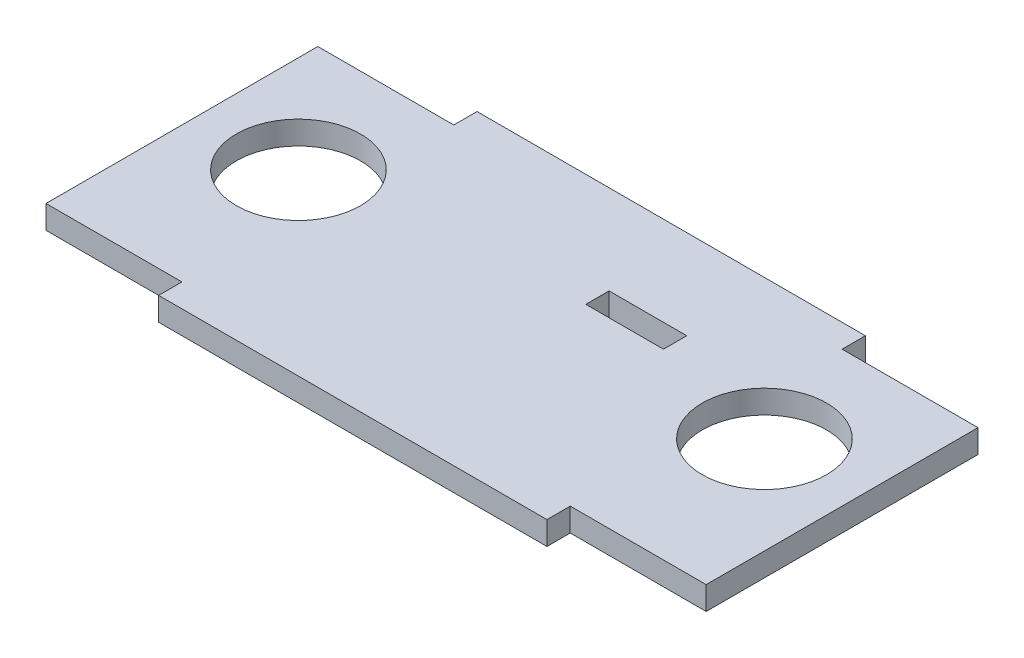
from build123d import *

# Parameters (mm, degrees)
SKETCH1_W           = 85
SKETCH1_H           = 50
BOSS_EXTRUDE1_DEPTH = 3
SKETCH2_R           = 8
CUT_EXTRUDE1_DEPTH  = 3
SKETCH4_W           = 16.5
SKETCH4_H           = 9
CUT_EXTRUDE2_DEPTH  = 3
SKETCH6_W           = 10
SKETCH6_H           = 12
BOSS_EXTRUDE2_DEPTH = 3
SKETCH7_W           = 10
SKETCH7_H           = 3
CUT_EXTRUDE3_DEPTH  = 3
SKETCH8_W           = 89.709473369
SKETCH8_H           = 15.102056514
CUT_EXTRUDE4_DEPTH  = 10
SKETCH9_W           = 17.5
SKETCH9_H           = 3
CUT_EXTRUDE5_DEPTH  = 3
SKETCH10_W          = 17.5
SKETCH10_H          = 3
CUT_EXTRUDE6_DEPTH  = 3


with BuildPart() as part:
    # Sketch1 → Boss-Extrude1 (new body)
    with BuildSketch(Plane(origin=(0, 0, 0), x_dir=(1, 0, 0), z_dir=(0, 1, 0))):
        Rectangle(SKETCH1_W, SKETCH1_H)
    extrude(amount=BOSS_EXTRUDE1_DEPTH)

    # Sketch2 → Cut-Extrude1 (cut)
    with BuildSketch(Plane(origin=(0, 3, 0), x_dir=(1, 0, 0), z_dir=(0, 1, 0))):
        with Locations(Location((-30, 7, 0), (0, 0, 270))):
            Circle(SKETCH2_R)
        with Locations(Location((30, 7, 0), (0, 0, 270))):
            Circle(SKETCH2_R)
    extrude(amount=-CUT_EXTRUDE1_DEPTH, mode=Mode.SUBTRACT)

    # Sketch4 → Cut-Extrude2 (cut)
    with BuildSketch(Plane(origin=(0, 3, 0), x_dir=(1, 0, 0), z_dir=(0, 1, 0))):
        with Locations((-8.25, -20.5)):
            Rectangle(SKETCH4_W, SKETCH4_H)
    cut_extrude2 = extrude(amount=-CUT_EXTRUDE2_DEPTH, mode=Mode.SUBTRACT)

    # Mirror1: Cut-Extrude2 across plane
    add(cut_extrude2.mirror(Plane(origin=(0, 0, 0), x_dir=(0, 0, 1), z_dir=(1, 0, 0))), mode=Mode.SUBTRACT)

    # Sketch6 → Boss-Extrude2 (add)
    with BuildSketch(Plane(origin=(0, 3, 0), x_dir=(1, 0, 0), z_dir=(0, 1, 0))):
        with Locations((0, -22)):
            Rectangle(SKETCH6_W, SKETCH6_H)
    extrude(amount=-BOSS_EXTRUDE2_DEPTH)

    # Sketch7 → Cut-Extrude3 (cut)
    with BuildSketch(Plane(origin=(0, 3, 0), x_dir=(1, 0, 0), z_dir=(0, 1, 0))):
        with Locations((8.5, 12)):
            Rectangle(SKETCH7_W, SKETCH7_H)
    extrude(amount=-CUT_EXTRUDE3_DEPTH, mode=Mode.SUBTRACT)

    # Sketch8 → Cut-Extrude4 (cut)
    with BuildSketch(Plane(origin=(0, 3, 0), x_dir=(1, 0, 0), z_dir=(0, 1, 0))):
        with Locations((2.354736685, -23.551028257)):
            Rectangle(SKETCH8_W, SKETCH8_H)
    extrude(amount=-CUT_EXTRUDE4_DEPTH, mode=Mode.SUBTRACT)

    # Sketch9 → Cut-Extrude5 (cut)
    with BuildSketch(Plane(origin=(0, 3, 0), x_dir=(1, 0, 0), z_dir=(0, 1, 0))):
        with Locations((-33.75, 23.5)):
            Rectangle(SKETCH9_W, SKETCH9_H)
    cut_extrude5 = extrude(amount=-CUT_EXTRUDE5_DEPTH, mode=Mode.SUBTRACT)

    # Mirror2: Cut-Extrude5 across plane
    add(cut_extrude5.mirror(Plane(origin=(0, 0, 0), x_dir=(0, 0, 1), z_dir=(1, 0, 0))), mode=Mode.SUBTRACT)

    # Sketch10 → Cut-Extrude6 (cut)
    with BuildSketch(Plane(origin=(0, 3, 0), x_dir=(1, 0, 0), z_dir=(0, 1, 0))):
        with Locations((-33.75, -14.5)):
            Rectangle(SKETCH10_W, SKETCH10_H)
    cut_extrude6 = extrude(amount=-CUT_EXTRUDE6_DEPTH, mode=Mode.SUBTRACT)

    # Mirror3: Cut-Extrude6 across plane
    add(cut_extrude6.mirror(Plane(origin=(0, 0, 0), x_dir=(0, 0, 1), z_dir=(1, 0, 0))), mode=Mode.SUBTRACT)


solid = part.part
